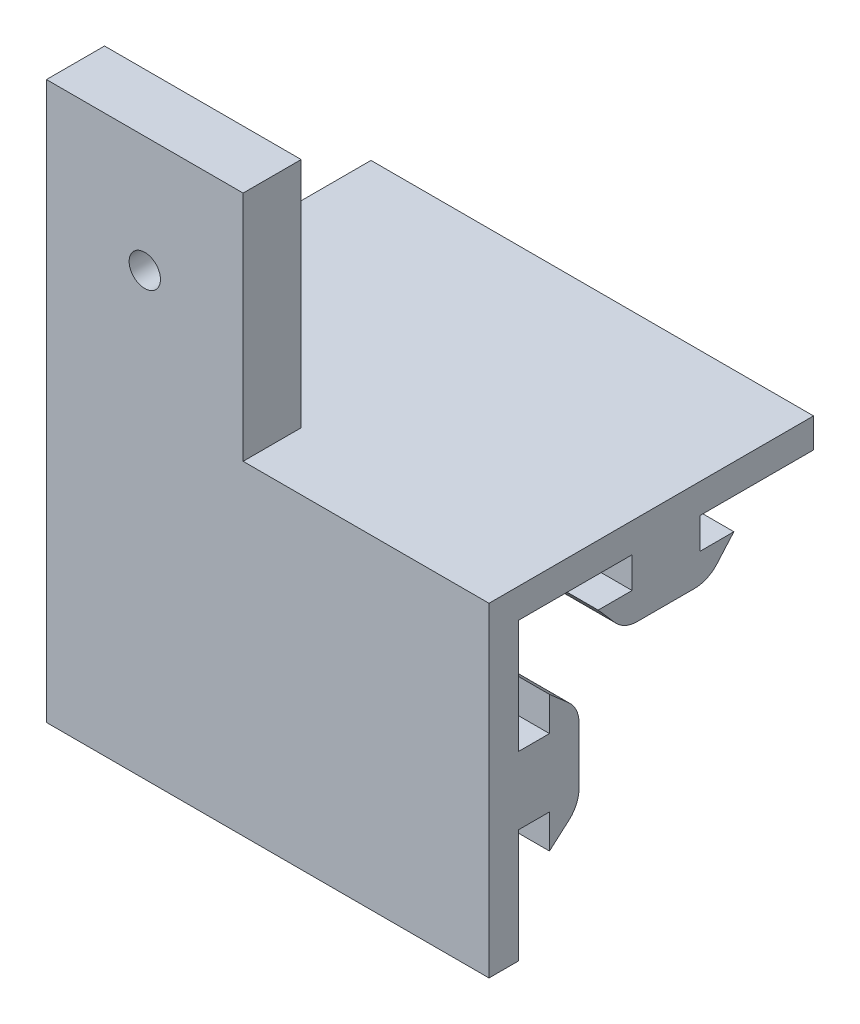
from build123d import *

# Parameters (mm, degrees)
SKETCH1_W           = 83.82
SKETCH1_H           = 25.4
BOSS_EXTRUDE1_DEPTH = 12.7
SKETCH4_W           = 38.1
SKETCH4_H           = 25.4
BOSS_EXTRUDE2_DEPTH = 38.1
SKETCH5_W           = 26.67
SKETCH5_H           = 26.67
CUT_EXTRUDE1_DEPTH  = 19.05
SKETCH7_R           = 3.429
CUT_EXTRUDE2_DEPTH  = 69.556477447
BOSS_EXTRUDE3_DEPTH = 83.82
SKETCH10_W          = 8
SKETCH10_H          = 4
CUT_EXTRUDE3_DEPTH  = 99.831788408
CUT_EXTRUDE4_DEPTH  = 6
SKETCH11_W          = 48.26
SKETCH11_H          = 25.4
CUT_EXTRUDE5_DEPTH  = 99.831788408
SKETCH12_W          = 33.02
SKETCH12_H          = 25.4
CUT_EXTRUDE6_DEPTH  = 45.471947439
SKETCH14_W          = 50.8
SKETCH14_H          = 2.54
BOSS_EXTRUDE4_DEPTH = 2.54
SKETCH16_W          = 29.63
SKETCH16_H          = 5
BOSS_EXTRUDE5_DEPTH = 20
SKETCH18_W          = 12.7
SKETCH18_H          = 47.94
CUT_EXTRUDE8_DEPTH  = 62.473159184
SKETCH19_R          = 1.35
CUT_EXTRUDE9_DEPTH  = 54.625789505


with BuildPart() as part:
    # Sketch1 → Boss-Extrude1 (new body)
    with BuildSketch(Plane.XY):
        Rectangle(SKETCH1_W, SKETCH1_H)
    extrude(amount=BOSS_EXTRUDE1_DEPTH)

    # Sketch4 → Boss-Extrude2 (add)
    with BuildSketch(Plane.XY.offset(12.7)):
        Rectangle(SKETCH4_W, SKETCH4_H)
    extrude(amount=BOSS_EXTRUDE2_DEPTH)

    # Sketch5 → Cut-Extrude1 (cut)
    with BuildSketch(Plane(origin=(0, 12.7, 0), x_dir=(1, 0, 0), z_dir=(0, 1, 0))):
        with Locations((0, -31.75)):
            Rectangle(SKETCH5_W, SKETCH5_H)
    extrude(amount=-CUT_EXTRUDE1_DEPTH, mode=Mode.SUBTRACT)

    # Sketch7 → Cut-Extrude2 (cut, through all)
    with BuildSketch(Plane(origin=(0, -6.35, 0), x_dir=(1, 0, 0), z_dir=(0, 1, 0))):
        with Locations(Location((0, -31.75, 0), (0, 0, 270))):
            Circle(SKETCH7_R)
    extrude(amount=-CUT_EXTRUDE2_DEPTH, mode=Mode.SUBTRACT)

    # Sketch8 → Boss-Extrude3 (add)
    with BuildSketch(Plane.ZY.offset(41.91)):
        with BuildLine():
            Line((-5.207, 2.465972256), (-5.207, -2.465972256))
            ThreePointArc((-5.207, -2.465972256), (-4.980177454, -3.515167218), (-4.340220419, -4.376975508))
            Line((-4.340220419, -4.376975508), (-2.667, -5.842))
            Line((-2.667, -5.842), (-2.667, -2.921))
            Line((-2.667, -2.921), (0, -2.921))
            Line((0, -2.921), (0, 2.921))
            Line((0, 2.921), (-2.667, 2.921))
            Line((-2.667, 2.921), (-2.667, 5.842))
            Line((-2.667, 5.842), (-4.340220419, 4.376975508))
            ThreePointArc((-4.340220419, 4.376975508), (-4.980177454, 3.515167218), (-5.207, 2.465972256))
        make_face()
    extrude(amount=-BOSS_EXTRUDE3_DEPTH)

    # Sketch10 → Cut-Extrude3 (cut, through all)
    with BuildSketch(Plane(origin=(41.91, 0, 0), x_dir=(0, 0, -1), z_dir=(1, 0, 0))):
        with Locations((-8.7, 5.62)):
            Rectangle(SKETCH10_W, SKETCH10_H)
    extrude(amount=-CUT_EXTRUDE3_DEPTH, mode=Mode.SUBTRACT)

    # Sketch3 → Cut-Extrude4 (cut)
    with BuildSketch(Plane.XY.offset(12.7)):
        with BuildLine():
            Line((41.91, -6.85999912), (41.91, -7.619999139))
            Line((41.91, -7.619999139), (41.91, -7.819999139))
            Line((41.91, -7.819999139), (31.565, -7.819999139))
            Line((31.565, -7.819999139), (29.050423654, -7.931023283))
            ThreePointArc((29.050423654, -7.931023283), (25.588978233, -9.27852412), (24.142995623, -12.7))
            Line((24.142995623, -12.7), (22.1752021, -12.7))
            ThreePointArc((22.1752021, -12.7), (24.344605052, -7.747051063), (29.45601841, -5.983116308))
            Line((29.45601841, -5.983116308), (32.865217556, -6.1))
            ThreePointArc((32.865217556, -6.1), (33.242134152, -6.253372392), (33.413114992, -6.62263485))
            Line((33.413114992, -6.62263485), (33.415, -6.62263485))
            Line((33.415, -6.62263485), (33.415, -6.71))
            ThreePointArc((33.415, -6.71), (33.458933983, -6.816066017), (33.565, -6.86))
            Line((33.565, -6.86), (34.156206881, -6.860000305))
            ThreePointArc((34.156206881, -6.860000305), (34.266332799, -6.811844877), (34.305750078, -6.698297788))
            ThreePointArc((34.305750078, -6.698297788), (34.304499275, -6.67711281), (34.304059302, -6.655895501))
            Line((34.304059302, -6.655895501), (34.304059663, -6.653448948))
            ThreePointArc((34.304059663, -6.653448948), (34.467161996, -6.262007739), (34.859057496, -6.1))
            Line((34.859057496, -6.1), (34.865217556, -6.1))
            ThreePointArc((34.865217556, -6.1), (35.242134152, -6.253372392), (35.413114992, -6.62263485))
            Line((35.413114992, -6.62263485), (35.415, -6.62263485))
            Line((35.415, -6.62263485), (35.415, -6.71))
            ThreePointArc((35.415, -6.71), (35.458933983, -6.816066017), (35.565, -6.86))
            Line((35.565, -6.86), (36.156206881, -6.860000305))
            ThreePointArc((36.156206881, -6.860000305), (36.266332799, -6.811844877), (36.305750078, -6.698297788))
            ThreePointArc((36.305750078, -6.698297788), (36.304499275, -6.67711281), (36.304059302, -6.655895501))
            Line((36.304059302, -6.655895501), (36.304059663, -6.653448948))
            ThreePointArc((36.304059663, -6.653448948), (36.467161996, -6.262007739), (36.859057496, -6.1))
            Line((36.859057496, -6.1), (36.865218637, -6.1))
            ThreePointArc((36.865218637, -6.1), (37.242151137, -6.253364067), (37.413140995, -6.622635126))
            Line((37.413140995, -6.622635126), (37.415026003, -6.622635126))
            Line((37.415026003, -6.622635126), (37.415026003, -6.710000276))
            ThreePointArc((37.415026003, -6.710000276), (37.458959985, -6.816066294), (37.565026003, -6.860000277))
            Line((37.565026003, -6.860000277), (38.156207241, -6.860000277))
            ThreePointArc((38.156207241, -6.860000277), (38.266333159, -6.811844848), (38.305750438, -6.69829776))
            ThreePointArc((38.305750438, -6.69829776), (38.304499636, -6.677112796), (38.304059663, -6.6558955))
            Line((38.304059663, -6.6558955), (38.304059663, -6.653448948))
            ThreePointArc((38.304059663, -6.653448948), (38.467161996, -6.262007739), (38.859057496, -6.1))
            Line((38.859057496, -6.1), (38.865193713, -6.1))
            ThreePointArc((38.865193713, -6.1), (39.242126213, -6.253364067), (39.413116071, -6.622635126))
            Line((39.413116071, -6.622635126), (39.415001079, -6.622635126))
            Line((39.415001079, -6.622635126), (39.415001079, -6.710000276))
            ThreePointArc((39.415001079, -6.710000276), (39.458935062, -6.816066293), (39.565001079, -6.860000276))
            Line((39.565001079, -6.860000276), (40.156207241, -6.859999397))
            ThreePointArc((40.156207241, -6.859999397), (40.266333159, -6.811843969), (40.305750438, -6.69829688))
            ThreePointArc((40.305750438, -6.69829688), (40.304499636, -6.677111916), (40.304059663, -6.65589462))
            Line((40.304059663, -6.65589462), (40.304059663, -6.653448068))
            ThreePointArc((40.304059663, -6.653448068), (40.467161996, -6.26200686), (40.859057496, -6.09999912))
            Line((40.859057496, -6.09999912), (40.865217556, -6.09999912))
            ThreePointArc((40.865217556, -6.09999912), (41.242134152, -6.253371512), (41.413114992, -6.62263397))
            Line((41.413114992, -6.62263397), (41.415000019, -6.62263397))
            Line((41.415000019, -6.62263397), (41.415000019, -6.70999912))
            ThreePointArc((41.415000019, -6.70999912), (41.458934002, -6.816065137), (41.565000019, -6.85999912))
            Line((41.565000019, -6.85999912), (41.91, -6.85999912))
        make_face()
        with BuildLine():
            Line((-41.910000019, -6.85999912), (-41.910000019, -7.821784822))
            Line((-41.910000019, -7.821784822), (-41.910000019, -8.021784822))
            Line((-41.910000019, -8.021784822), (-22.860000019, -8.021784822))
            Line((-22.860000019, -8.021784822), (-22.860000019, -7.821784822))
            Line((-22.860000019, -7.821784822), (-22.860000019, -7.37263483))
            Line((-22.860000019, -7.37263483), (-22.865217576, -6.099999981))
            ThreePointArc((-22.865217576, -6.099999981), (-23.242134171, -6.253372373), (-23.413115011, -6.62263483))
            Line((-23.413115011, -6.62263483), (-23.415000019, -6.62263483))
            Line((-23.415000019, -6.62263483), (-23.415000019, -6.709999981))
            ThreePointArc((-23.415000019, -6.709999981), (-23.458934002, -6.816065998), (-23.565000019, -6.859999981))
            Line((-23.565000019, -6.859999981), (-24.156207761, -6.860000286))
            ThreePointArc((-24.156207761, -6.860000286), (-24.266333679, -6.811844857), (-24.305750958, -6.698297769))
            ThreePointArc((-24.305750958, -6.698297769), (-24.304480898, -6.676624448), (-24.304059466, -6.654918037))
            Line((-24.304059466, -6.654918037), (-24.304059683, -6.653448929))
            ThreePointArc((-24.304059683, -6.653448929), (-24.467162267, -6.262007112), (-24.859058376, -6.09999912))
            Line((-24.859058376, -6.09999912), (-24.865217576, -6.09999912))
            ThreePointArc((-24.865217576, -6.09999912), (-25.242155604, -6.253318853), (-25.413188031, -6.622557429))
            Line((-25.413188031, -6.622557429), (-25.415075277, -6.622557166))
            Line((-25.415075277, -6.622557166), (-25.415081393, -6.710100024))
            ThreePointArc((-25.415081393, -6.710100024), (-25.459022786, -6.816162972), (-25.565091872, -6.860089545))
            Line((-25.565091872, -6.860089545), (-26.156298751, -6.860048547))
            ThreePointArc((-26.156298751, -6.860048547), (-26.266421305, -6.811885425), (-26.305830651, -6.698335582))
            ThreePointArc((-26.305830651, -6.698335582), (-26.304579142, -6.677170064), (-26.30413698, -6.655972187))
            Line((-26.30413698, -6.655972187), (-26.30413698, -6.653525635))
            ThreePointArc((-26.30413698, -6.653525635), (-26.467212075, -6.262034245), (-26.859135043, -6.09999912))
            Line((-26.859135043, -6.09999912), (-26.865445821, -6.09999912))
            ThreePointArc((-26.865445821, -6.09999912), (-27.242216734, -6.253447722), (-27.413114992, -6.622631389))
            Line((-27.413114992, -6.622631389), (-27.415, -6.622631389))
            Line((-27.415, -6.622631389), (-27.415, -6.71))
            ThreePointArc((-27.415, -6.71), (-27.458933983, -6.816066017), (-27.565, -6.86))
            Line((-27.565, -6.86), (-28.156206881, -6.860000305))
            ThreePointArc((-28.156206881, -6.860000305), (-28.266332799, -6.811844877), (-28.305750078, -6.698297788))
            ThreePointArc((-28.305750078, -6.698297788), (-28.304499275, -6.67711281), (-28.304059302, -6.655895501))
            Line((-28.304059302, -6.655895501), (-28.304059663, -6.653448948))
            ThreePointArc((-28.304059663, -6.653448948), (-28.467161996, -6.262007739), (-28.859057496, -6.1))
            Line((-28.859057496, -6.1), (-28.865217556, -6.1))
            ThreePointArc((-28.865217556, -6.1), (-29.242134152, -6.253372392), (-29.413114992, -6.62263485))
            Line((-29.413114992, -6.62263485), (-29.415, -6.62263485))
            Line((-29.415, -6.62263485), (-29.415, -6.71))
            ThreePointArc((-29.415, -6.71), (-29.458933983, -6.816066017), (-29.565, -6.86))
            Line((-29.565, -6.86), (-30.156206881, -6.860000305))
            ThreePointArc((-30.156206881, -6.860000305), (-30.266332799, -6.811844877), (-30.305750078, -6.698297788))
            ThreePointArc((-30.305750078, -6.698297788), (-30.304499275, -6.67711281), (-30.304059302, -6.655895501))
            Line((-30.304059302, -6.655895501), (-30.304059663, -6.653448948))
            ThreePointArc((-30.304059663, -6.653448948), (-30.467161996, -6.262007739), (-30.859057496, -6.1))
            Line((-30.859057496, -6.1), (-30.865217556, -6.1))
            ThreePointArc((-30.865217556, -6.1), (-31.242134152, -6.253372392), (-31.413114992, -6.62263485))
            Line((-31.413114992, -6.62263485), (-31.415, -6.62263485))
            Line((-31.415, -6.62263485), (-31.415, -6.71))
            ThreePointArc((-31.415, -6.71), (-31.458933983, -6.816066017), (-31.565, -6.86))
            Line((-31.565, -6.86), (-32.156206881, -6.860000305))
            ThreePointArc((-32.156206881, -6.860000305), (-32.266332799, -6.811844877), (-32.305750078, -6.698297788))
            ThreePointArc((-32.305750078, -6.698297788), (-32.304499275, -6.67711281), (-32.304059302, -6.655895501))
            Line((-32.304059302, -6.655895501), (-32.304059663, -6.653448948))
            ThreePointArc((-32.304059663, -6.653448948), (-32.467161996, -6.262007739), (-32.859057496, -6.1))
            Line((-32.859057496, -6.1), (-32.865217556, -6.1))
            ThreePointArc((-32.865217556, -6.1), (-33.242134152, -6.253372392), (-33.413114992, -6.62263485))
            Line((-33.413114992, -6.62263485), (-33.415, -6.62263485))
            Line((-33.415, -6.62263485), (-33.415, -6.71))
            ThreePointArc((-33.415, -6.71), (-33.458933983, -6.816066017), (-33.565, -6.86))
            Line((-33.565, -6.86), (-34.156206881, -6.860000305))
            ThreePointArc((-34.156206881, -6.860000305), (-34.266332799, -6.811844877), (-34.305750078, -6.698297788))
            ThreePointArc((-34.305750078, -6.698297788), (-34.304499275, -6.67711281), (-34.304059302, -6.655895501))
            Line((-34.304059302, -6.655895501), (-34.304059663, -6.653448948))
            ThreePointArc((-34.304059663, -6.653448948), (-34.467161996, -6.262007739), (-34.859057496, -6.1))
            Line((-34.859057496, -6.1), (-34.865217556, -6.1))
            ThreePointArc((-34.865217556, -6.1), (-35.242134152, -6.253372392), (-35.413114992, -6.62263485))
            Line((-35.413114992, -6.62263485), (-35.415, -6.62263485))
            Line((-35.415, -6.62263485), (-35.415, -6.71))
            ThreePointArc((-35.415, -6.71), (-35.458933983, -6.816066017), (-35.565, -6.86))
            Line((-35.565, -6.86), (-36.156206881, -6.860000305))
            ThreePointArc((-36.156206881, -6.860000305), (-36.266332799, -6.811844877), (-36.305750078, -6.698297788))
            ThreePointArc((-36.305750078, -6.698297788), (-36.304499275, -6.67711281), (-36.304059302, -6.655895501))
            Line((-36.304059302, -6.655895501), (-36.304059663, -6.653448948))
            ThreePointArc((-36.304059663, -6.653448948), (-36.467161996, -6.262007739), (-36.859057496, -6.1))
            Line((-36.859057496, -6.1), (-36.865218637, -6.1))
            ThreePointArc((-36.865218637, -6.1), (-37.242151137, -6.253364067), (-37.413140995, -6.622635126))
            Line((-37.413140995, -6.622635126), (-37.415026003, -6.710000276))
            ThreePointArc((-37.415026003, -6.710000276), (-37.458959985, -6.816066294), (-37.565026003, -6.860000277))
            Line((-37.565026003, -6.860000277), (-38.156207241, -6.860000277))
            ThreePointArc((-38.156207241, -6.860000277), (-38.266333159, -6.811844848), (-38.305750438, -6.69829776))
            Line((-38.305750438, -6.69829776), (-38.304059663, -6.653448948))
            ThreePointArc((-38.304059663, -6.653448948), (-38.467161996, -6.262007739), (-38.859057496, -6.1))
            Line((-38.859057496, -6.1), (-38.865193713, -6.1))
            ThreePointArc((-38.865193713, -6.1), (-39.242126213, -6.253364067), (-39.413116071, -6.622635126))
            Line((-39.413116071, -6.622635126), (-39.415001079, -6.710000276))
            ThreePointArc((-39.415001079, -6.710000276), (-39.458935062, -6.816066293), (-39.565001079, -6.860000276))
            Line((-39.565001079, -6.860000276), (-40.156207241, -6.859999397))
            ThreePointArc((-40.156207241, -6.859999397), (-40.266333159, -6.811843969), (-40.305750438, -6.69829688))
            Line((-40.305750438, -6.69829688), (-40.304059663, -6.653448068))
            ThreePointArc((-40.304059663, -6.653448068), (-40.467161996, -6.26200686), (-40.859057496, -6.09999912))
            Line((-40.859057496, -6.09999912), (-40.865217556, -6.09999912))
            ThreePointArc((-40.865217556, -6.09999912), (-41.242134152, -6.253371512), (-41.413114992, -6.62263397))
            Line((-41.413114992, -6.62263397), (-41.415000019, -6.70999912))
            ThreePointArc((-41.415000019, -6.70999912), (-41.458934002, -6.816065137), (-41.565000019, -6.85999912))
            Line((-41.565000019, -6.85999912), (-41.910000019, -6.85999912))
        make_face()
    extrude(amount=-CUT_EXTRUDE4_DEPTH, mode=Mode.SUBTRACT)

    # Sketch11 → Cut-Extrude5 (cut, through all)
    with BuildSketch(Plane.ZY.offset(41.91)):
        with Locations((26.67, 0)):
            Rectangle(SKETCH11_W, SKETCH11_H)
    extrude(amount=-CUT_EXTRUDE5_DEPTH, mode=Mode.SUBTRACT)

    # Sketch12 → Cut-Extrude6 (cut, through all)
    with BuildSketch(Plane.XY.offset(2.54)):
        with Locations((25.4, 0)):
            Rectangle(SKETCH12_W, SKETCH12_H)
    extrude(amount=-CUT_EXTRUDE6_DEPTH, mode=Mode.SUBTRACT)

    # Sketch14 → Boss-Extrude4 (add)
    with BuildSketch(Plane(origin=(0, 12.7, 0), x_dir=(1, 0, 0), z_dir=(0, 1, 0))):
        with Locations((-16.51, -1.27)):
            Rectangle(SKETCH14_W, SKETCH14_H)
    extrude(amount=BOSS_EXTRUDE4_DEPTH)

    # Mirror4: part across plane


with BuildPart() as part_1:
    add(part.part)
    add(part.part.mirror(Plane(origin=(0, 6.35, -6.35), x_dir=(0, 0.7071067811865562, 0.7071067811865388), z_dir=(0, -0.7071067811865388, 0.7071067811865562))))

    # Sketch16 → Boss-Extrude5 (add)
    with BuildSketch(Plane(origin=(0, 15.24, 0), x_dir=(1, 0, 0), z_dir=(0, 1, 0))):
        with Locations((-27.095, -0.04)):
            Rectangle(SKETCH16_W, SKETCH16_H)
    extrude(amount=BOSS_EXTRUDE5_DEPTH)

    # Sketch18 → Cut-Extrude8 (cut, through all)
    with BuildSketch(Plane.XY.offset(2.54)):
        with Locations((-35.56, 11.27)):
            Rectangle(SKETCH18_W, SKETCH18_H)
    extrude(amount=-CUT_EXTRUDE8_DEPTH, mode=Mode.SUBTRACT)

    # Sketch19 → Cut-Extrude9 (cut, through all)
    with BuildSketch(Plane.XY.offset(2.54)):
        with Locations((-20.745, 25.24)):
            Circle(SKETCH19_R)
    extrude(amount=-CUT_EXTRUDE9_DEPTH, mode=Mode.SUBTRACT)


solid = part_1.part
